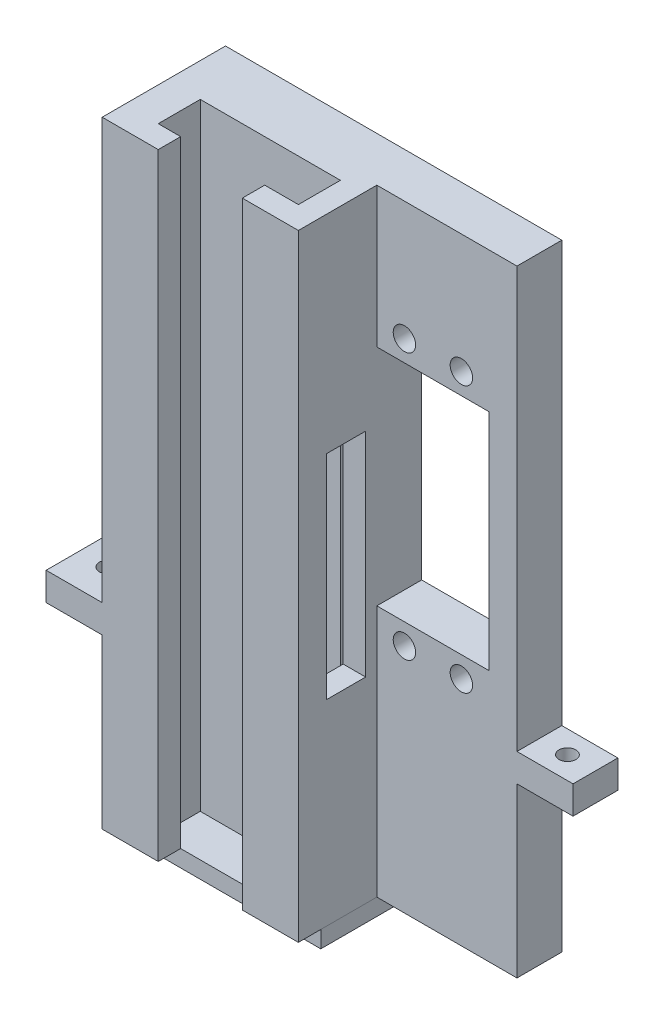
ISO-10303-21;
HEADER;
FILE_DESCRIPTION(('STEP AP214'),'2;1');
FILE_NAME('part.step','',(''),(''),'','','');
FILE_SCHEMA(('AUTOMOTIVE_DESIGN { 1 0 10303 214 1 1 1 1 }'));
ENDSEC;
DATA;
#1=APPLICATION_CONTEXT('core data for automotive mechanical design processes');
#2=APPLICATION_PROTOCOL_DEFINITION('international standard','automotive_design',2000,#1);
#3=PRODUCT_CONTEXT('',#1,'mechanical');
#4=PRODUCT('Part','Part','',(#3));
#5=PRODUCT_RELATED_PRODUCT_CATEGORY('part','',(#4));
#6=PRODUCT_DEFINITION_FORMATION('','',#4);
#7=PRODUCT_DEFINITION_CONTEXT('part definition',#1,'design');
#8=PRODUCT_DEFINITION('design','',#6,#7);
#9=PRODUCT_DEFINITION_SHAPE('','',#8);
#10=(LENGTH_UNIT() NAMED_UNIT(*) SI_UNIT(.MILLI.,.METRE.));
#11=(NAMED_UNIT(*) PLANE_ANGLE_UNIT() SI_UNIT($,.RADIAN.));
#12=(NAMED_UNIT(*) SI_UNIT($,.STERADIAN.) SOLID_ANGLE_UNIT());
#13=UNCERTAINTY_MEASURE_WITH_UNIT(LENGTH_MEASURE(1.E-05),#10,'distance_accuracy_value','');
#14=(GEOMETRIC_REPRESENTATION_CONTEXT(3) GLOBAL_UNCERTAINTY_ASSIGNED_CONTEXT((#13)) GLOBAL_UNIT_ASSIGNED_CONTEXT((#10,
#11,#12)) REPRESENTATION_CONTEXT('',''));
#15=CARTESIAN_POINT('',(0.,0.,0.));
#16=DIRECTION('',(0.,0.,1.));
#17=DIRECTION('',(1.,0.,0.));
#18=AXIS2_PLACEMENT_3D('',#15,#16,#17);
#19=CARTESIAN_POINT('',(-17.5,-73.,9.99999999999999));
#20=DIRECTION('',(1.,0.,0.));
#21=DIRECTION('',(0.,0.,-1.));
#22=AXIS2_PLACEMENT_3D('',#19,#20,#21);
#23=PLANE('',#22);
#24=DIRECTION('',(0.,0.,-1.));
#25=VECTOR('',#24,1.);
#26=CARTESIAN_POINT('',(-17.5,-70.,9.99999999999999));
#27=LINE('',#26,#25);
#28=CARTESIAN_POINT('',(-17.5,-70.,9.99999999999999));
#29=VERTEX_POINT('',#28);
#30=CARTESIAN_POINT('',(-17.5,-70.,-8.));
#31=VERTEX_POINT('',#30);
#32=EDGE_CURVE('E106',#29,#31,#27,.T.);
#33=ORIENTED_EDGE('',*,*,#32,.T.);
#34=DIRECTION('',(0.,1.,0.));
#35=VECTOR('',#34,1.);
#36=CARTESIAN_POINT('',(-17.5,-73.,-8.));
#37=LINE('',#36,#35);
#38=CARTESIAN_POINT('',(-17.5,-73.,-8.));
#39=VERTEX_POINT('',#38);
#40=EDGE_CURVE('E12',#39,#31,#37,.T.);
#41=ORIENTED_EDGE('',*,*,#40,.F.);
#42=DIRECTION('',(0.,0.,-1.));
#43=VECTOR('',#42,1.);
#44=CARTESIAN_POINT('',(-17.5,-73.,9.99999999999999));
#45=LINE('',#44,#43);
#46=CARTESIAN_POINT('',(-17.5,-73.,9.99999999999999));
#47=VERTEX_POINT('',#46);
#48=EDGE_CURVE('E94',#47,#39,#45,.T.);
#49=ORIENTED_EDGE('',*,*,#48,.F.);
#50=DIRECTION('',(0.,1.,0.));
#51=VECTOR('',#50,1.);
#52=CARTESIAN_POINT('',(-17.5,-73.,9.99999999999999));
#53=LINE('',#52,#51);
#54=EDGE_CURVE('E102',#47,#29,#53,.T.);
#55=ORIENTED_EDGE('',*,*,#54,.T.);
#56=EDGE_LOOP('',(#33,#41,#49,#55));
#57=FACE_BOUND('',#56,.T.);
#58=ADVANCED_FACE('F43',(#57),#23,.F.);
#59=CARTESIAN_POINT('',(-17.5,-73.,-8.));
#60=DIRECTION('',(0.,0.,1.));
#61=DIRECTION('',(1.,0.,0.));
#62=AXIS2_PLACEMENT_3D('',#59,#60,#61);
#63=PLANE('',#62);
#64=DIRECTION('',(1.,0.,0.));
#65=VECTOR('',#64,1.);
#66=CARTESIAN_POINT('',(-17.5,-70.,-8.));
#67=LINE('',#66,#65);
#68=CARTESIAN_POINT('',(17.5,-70.,-8.00000000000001));
#69=VERTEX_POINT('',#68);
#70=EDGE_CURVE('E98',#31,#69,#67,.T.);
#71=ORIENTED_EDGE('',*,*,#70,.T.);
#72=DIRECTION('',(0.,1.,0.));
#73=VECTOR('',#72,1.);
#74=CARTESIAN_POINT('',(17.5,-73.,-8.00000000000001));
#75=LINE('',#74,#73);
#76=CARTESIAN_POINT('',(17.5,-73.,-8.00000000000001));
#77=VERTEX_POINT('',#76);
#78=EDGE_CURVE('E51',#77,#69,#75,.T.);
#79=ORIENTED_EDGE('',*,*,#78,.F.);
#80=DIRECTION('',(1.,0.,0.));
#81=VECTOR('',#80,1.);
#82=CARTESIAN_POINT('',(-17.5,-73.,-8.));
#83=LINE('',#82,#81);
#84=EDGE_CURVE('E89',#39,#77,#83,.T.);
#85=ORIENTED_EDGE('',*,*,#84,.F.);
#86=ORIENTED_EDGE('',*,*,#40,.T.);
#87=EDGE_LOOP('',(#71,#79,#85,#86));
#88=FACE_BOUND('',#87,.T.);
#89=ADVANCED_FACE('F97',(#88),#63,.F.);
#90=CARTESIAN_POINT('',(17.5,-73.,10.));
#91=DIRECTION('',(-1.,0.,0.));
#92=DIRECTION('',(0.,0.,1.));
#93=AXIS2_PLACEMENT_3D('',#90,#91,#92);
#94=PLANE('',#93);
#95=DIRECTION('',(0.,0.,1.));
#96=VECTOR('',#95,1.);
#97=CARTESIAN_POINT('',(17.5,-70.,10.));
#98=LINE('',#97,#96);
#99=CARTESIAN_POINT('',(17.5,-70.,10.));
#100=VERTEX_POINT('',#99);
#101=EDGE_CURVE('E76',#69,#100,#98,.T.);
#102=ORIENTED_EDGE('',*,*,#101,.T.);
#103=DIRECTION('',(0.,1.,0.));
#104=VECTOR('',#103,1.);
#105=CARTESIAN_POINT('',(17.5,-73.,10.));
#106=LINE('',#105,#104);
#107=CARTESIAN_POINT('',(17.5,-73.,10.));
#108=VERTEX_POINT('',#107);
#109=EDGE_CURVE('E99',#108,#100,#106,.T.);
#110=ORIENTED_EDGE('',*,*,#109,.F.);
#111=DIRECTION('',(0.,0.,1.));
#112=VECTOR('',#111,1.);
#113=CARTESIAN_POINT('',(17.5,-73.,10.));
#114=LINE('',#113,#112);
#115=EDGE_CURVE('E92',#77,#108,#114,.T.);
#116=ORIENTED_EDGE('',*,*,#115,.F.);
#117=ORIENTED_EDGE('',*,*,#78,.T.);
#118=EDGE_LOOP('',(#102,#110,#116,#117));
#119=FACE_BOUND('',#118,.T.);
#120=ADVANCED_FACE('F100',(#119),#94,.F.);
#121=CARTESIAN_POINT('',(-17.5,-73.,9.99999999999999));
#122=DIRECTION('',(0.,0.,-1.));
#123=DIRECTION('',(-1.,0.,0.));
#124=AXIS2_PLACEMENT_3D('',#121,#122,#123);
#125=PLANE('',#124);
#126=DIRECTION('',(-1.,0.,0.));
#127=VECTOR('',#126,1.);
#128=CARTESIAN_POINT('',(-17.5,-70.,9.99999999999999));
#129=LINE('',#128,#127);
#130=EDGE_CURVE('E82',#100,#29,#129,.T.);
#131=ORIENTED_EDGE('',*,*,#130,.T.);
#132=ORIENTED_EDGE('',*,*,#54,.F.);
#133=DIRECTION('',(-1.,0.,0.));
#134=VECTOR('',#133,1.);
#135=CARTESIAN_POINT('',(-17.5,-73.,9.99999999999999));
#136=LINE('',#135,#134);
#137=EDGE_CURVE('E59',#108,#47,#136,.T.);
#138=ORIENTED_EDGE('',*,*,#137,.F.);
#139=ORIENTED_EDGE('',*,*,#109,.T.);
#140=EDGE_LOOP('',(#131,#132,#138,#139));
#141=FACE_BOUND('',#140,.T.);
#142=ADVANCED_FACE('F113',(#141),#125,.F.);
#143=CARTESIAN_POINT('',(0.,-73.,0.));
#144=DIRECTION('',(0.,-1.,0.));
#145=DIRECTION('',(0.,0.,-1.));
#146=AXIS2_PLACEMENT_3D('',#143,#144,#145);
#147=PLANE('',#146);
#148=ORIENTED_EDGE('',*,*,#48,.T.);
#149=ORIENTED_EDGE('',*,*,#84,.T.);
#150=ORIENTED_EDGE('',*,*,#115,.T.);
#151=ORIENTED_EDGE('',*,*,#137,.T.);
#152=EDGE_LOOP('',(#148,#149,#150,#151));
#153=FACE_BOUND('',#152,.T.);
#154=ADVANCED_FACE('F90',(#153),#147,.T.);
#155=CARTESIAN_POINT('',(0.,-70.,0.));
#156=DIRECTION('',(0.,-1.,0.));
#157=DIRECTION('',(0.,0.,-1.));
#158=AXIS2_PLACEMENT_3D('',#155,#156,#157);
#159=PLANE('',#158);
#160=ORIENTED_EDGE('',*,*,#32,.F.);
#161=ORIENTED_EDGE('',*,*,#130,.F.);
#162=ORIENTED_EDGE('',*,*,#101,.F.);
#163=ORIENTED_EDGE('',*,*,#70,.F.);
#164=EDGE_LOOP('',(#160,#161,#162,#163));
#165=FACE_BOUND('',#164,.T.);
#166=ADVANCED_FACE('F116',(#165),#159,.F.);
#167=CLOSED_SHELL('',(#58,#89,#120,#142,#154,#166));
#168=MANIFOLD_SOLID_BREP('B2',#167);
#169=CARTESIAN_POINT('',(42.5,40.,112.805141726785));
#170=DIRECTION('',(1.,0.,0.));
#171=DIRECTION('',(0.,1.,0.));
#172=AXIS2_PLACEMENT_3D('',#169,#170,#171);
#173=PLANE('',#172);
#174=DIRECTION('',(0.,-1.,0.));
#175=VECTOR('',#174,1.);
#176=CARTESIAN_POINT('',(42.5,40.,0.));
#177=LINE('',#176,#175);
#178=CARTESIAN_POINT('',(42.5,40.,0.));
#179=VERTEX_POINT('',#178);
#180=CARTESIAN_POINT('',(42.5,-35.,0.));
#181=VERTEX_POINT('',#180);
#182=EDGE_CURVE('E581',#179,#181,#177,.T.);
#183=ORIENTED_EDGE('',*,*,#182,.T.);
#184=DIRECTION('',(0.,0.,-1.));
#185=VECTOR('',#184,1.);
#186=CARTESIAN_POINT('',(42.5,-35.,0.));
#187=LINE('',#186,#185);
#188=CARTESIAN_POINT('',(42.5,-35.,-8.00000000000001));
#189=VERTEX_POINT('',#188);
#190=EDGE_CURVE('E182',#181,#189,#187,.T.);
#191=ORIENTED_EDGE('',*,*,#190,.T.);
#192=DIRECTION('',(0.,-1.,0.));
#193=VECTOR('',#192,1.);
#194=CARTESIAN_POINT('',(42.5,40.,-8.00000000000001));
#195=LINE('',#194,#193);
#196=CARTESIAN_POINT('',(42.5,40.,-8.00000000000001));
#197=VERTEX_POINT('',#196);
#198=EDGE_CURVE('E400',#197,#189,#195,.T.);
#199=ORIENTED_EDGE('',*,*,#198,.F.);
#200=DIRECTION('',(0.,0.,-1.));
#201=VECTOR('',#200,1.);
#202=CARTESIAN_POINT('',(42.5,40.,112.805141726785));
#203=LINE('',#202,#201);
#204=EDGE_CURVE('E586',#179,#197,#203,.T.);
#205=ORIENTED_EDGE('',*,*,#204,.F.);
#206=EDGE_LOOP('',(#183,#191,#199,#205));
#207=FACE_BOUND('',#206,.T.);
#208=ADVANCED_FACE('F167',(#207),#173,.T.);
#209=CARTESIAN_POINT('',(-17.5,-70.,-8.));
#210=DIRECTION('',(-1.,0.,0.));
#211=DIRECTION('',(0.,0.,1.));
#212=AXIS2_PLACEMENT_3D('',#209,#210,#211);
#213=PLANE('',#212);
#214=DIRECTION('',(0.,1.,0.));
#215=VECTOR('',#214,1.);
#216=CARTESIAN_POINT('',(-17.5,-70.,-8.));
#217=LINE('',#216,#215);
#218=CARTESIAN_POINT('',(-17.5,-35.,-8.));
#219=VERTEX_POINT('',#218);
#220=CARTESIAN_POINT('',(-17.5,40.,-8.));
#221=VERTEX_POINT('',#220);
#222=EDGE_CURVE('E694',#219,#221,#217,.T.);
#223=ORIENTED_EDGE('',*,*,#222,.F.);
#224=DIRECTION('',(0.,0.,1.));
#225=VECTOR('',#224,1.);
#226=CARTESIAN_POINT('',(-17.5,-35.,14.));
#227=LINE('',#226,#225);
#228=CARTESIAN_POINT('',(-17.5,-35.,14.));
#229=VERTEX_POINT('',#228);
#230=EDGE_CURVE('E448',#219,#229,#227,.T.);
#231=ORIENTED_EDGE('',*,*,#230,.T.);
#232=DIRECTION('',(0.,1.,0.));
#233=VECTOR('',#232,1.);
#234=CARTESIAN_POINT('',(-17.5,-70.,14.));
#235=LINE('',#234,#233);
#236=CARTESIAN_POINT('',(-17.5,40.,14.));
#237=VERTEX_POINT('',#236);
#238=EDGE_CURVE('E691',#229,#237,#235,.T.);
#239=ORIENTED_EDGE('',*,*,#238,.T.);
#240=DIRECTION('',(0.,0.,1.));
#241=VECTOR('',#240,1.);
#242=CARTESIAN_POINT('',(-17.5,40.,-8.));
#243=LINE('',#242,#241);
#244=EDGE_CURVE('E633',#221,#237,#243,.T.);
#245=ORIENTED_EDGE('',*,*,#244,.F.);
#246=EDGE_LOOP('',(#223,#231,#239,#245));
#247=FACE_BOUND('',#246,.T.);
#248=ADVANCED_FACE('F772',(#247),#213,.T.);
#249=CARTESIAN_POINT('',(17.5,-70.,14.));
#250=DIRECTION('',(1.,0.,0.));
#251=DIRECTION('',(0.,0.,-1.));
#252=AXIS2_PLACEMENT_3D('',#249,#250,#251);
#253=PLANE('',#252);
#254=DIRECTION('',(0.,1.,0.));
#255=VECTOR('',#254,1.);
#256=CARTESIAN_POINT('',(17.5,40.,0.));
#257=LINE('',#256,#255);
#258=CARTESIAN_POINT('',(17.5,-70.,0.));
#259=VERTEX_POINT('',#258);
#260=CARTESIAN_POINT('',(17.5,-25.,0.));
#261=VERTEX_POINT('',#260);
#262=EDGE_CURVE('E573',#259,#261,#257,.T.);
#263=ORIENTED_EDGE('',*,*,#262,.T.);
#264=DIRECTION('',(0.,0.,-1.));
#265=VECTOR('',#264,1.);
#266=CARTESIAN_POINT('',(17.5,-25.,46.7213595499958));
#267=LINE('',#266,#265);
#268=CARTESIAN_POINT('',(17.5,-25.,-8.));
#269=VERTEX_POINT('',#268);
#270=EDGE_CURVE('E568',#261,#269,#267,.T.);
#271=ORIENTED_EDGE('',*,*,#270,.T.);
#272=DIRECTION('',(0.,1.,0.));
#273=VECTOR('',#272,1.);
#274=CARTESIAN_POINT('',(17.5,15.,-8.));
#275=LINE('',#274,#273);
#276=CARTESIAN_POINT('',(17.5,15.,-8.));
#277=VERTEX_POINT('',#276);
#278=EDGE_CURVE('E558',#269,#277,#275,.T.);
#279=ORIENTED_EDGE('',*,*,#278,.T.);
#280=DIRECTION('',(0.,0.,-1.));
#281=VECTOR('',#280,1.);
#282=CARTESIAN_POINT('',(17.5,15.,46.7213595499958));
#283=LINE('',#282,#281);
#284=CARTESIAN_POINT('',(17.5,15.,0.));
#285=VERTEX_POINT('',#284);
#286=EDGE_CURVE('E566',#285,#277,#283,.T.);
#287=ORIENTED_EDGE('',*,*,#286,.F.);
#288=CARTESIAN_POINT('',(17.5,40.,0.));
#289=VERTEX_POINT('',#288);
#290=EDGE_CURVE('E572',#285,#289,#257,.T.);
#291=ORIENTED_EDGE('',*,*,#290,.T.);
#292=DIRECTION('',(0.,0.,-1.));
#293=VECTOR('',#292,1.);
#294=CARTESIAN_POINT('',(17.5,40.,14.));
#295=LINE('',#294,#293);
#296=CARTESIAN_POINT('',(17.5,40.,14.));
#297=VERTEX_POINT('',#296);
#298=EDGE_CURVE('E627',#297,#289,#295,.T.);
#299=ORIENTED_EDGE('',*,*,#298,.F.);
#300=DIRECTION('',(0.,1.,0.));
#301=VECTOR('',#300,1.);
#302=CARTESIAN_POINT('',(17.5,-70.,14.));
#303=LINE('',#302,#301);
#304=CARTESIAN_POINT('',(17.5,-70.,14.));
#305=VERTEX_POINT('',#304);
#306=EDGE_CURVE('E695',#305,#297,#303,.T.);
#307=ORIENTED_EDGE('',*,*,#306,.F.);
#308=DIRECTION('',(0.,0.,-1.));
#309=VECTOR('',#308,1.);
#310=CARTESIAN_POINT('',(17.5,-70.,14.));
#311=LINE('',#310,#309);
#312=EDGE_CURVE('E656',#305,#259,#311,.T.);
#313=ORIENTED_EDGE('',*,*,#312,.T.);
#314=EDGE_LOOP('',(#263,#271,#279,#287,#291,#299,#307,#313));
#315=FACE_BOUND('',#314,.T.);
#316=DIRECTION('',(0.,0.,1.));
#317=VECTOR('',#316,1.);
#318=CARTESIAN_POINT('',(17.5,2.99999999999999,9.));
#319=LINE('',#318,#317);
#320=CARTESIAN_POINT('',(17.5,2.99999999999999,2.));
#321=VERTEX_POINT('',#320);
#322=CARTESIAN_POINT('',(17.5,2.99999999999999,9.));
#323=VERTEX_POINT('',#322);
#324=EDGE_CURVE('E596',#321,#323,#319,.T.);
#325=ORIENTED_EDGE('',*,*,#324,.F.);
#326=DIRECTION('',(0.,1.,0.));
#327=VECTOR('',#326,1.);
#328=CARTESIAN_POINT('',(17.5,2.99999999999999,2.));
#329=LINE('',#328,#327);
#330=CARTESIAN_POINT('',(17.5,-35.,1.99999999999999));
#331=VERTEX_POINT('',#330);
#332=EDGE_CURVE('E594',#331,#321,#329,.T.);
#333=ORIENTED_EDGE('',*,*,#332,.F.);
#334=DIRECTION('',(0.,0.,-1.));
#335=VECTOR('',#334,1.);
#336=CARTESIAN_POINT('',(17.5,-35.,8.99999999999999));
#337=LINE('',#336,#335);
#338=CARTESIAN_POINT('',(17.5,-35.,8.99999999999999));
#339=VERTEX_POINT('',#338);
#340=EDGE_CURVE('E591',#339,#331,#337,.T.);
#341=ORIENTED_EDGE('',*,*,#340,.F.);
#342=DIRECTION('',(0.,-1.,0.));
#343=VECTOR('',#342,1.);
#344=CARTESIAN_POINT('',(17.5,2.99999999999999,9.));
#345=LINE('',#344,#343);
#346=EDGE_CURVE('E580',#323,#339,#345,.T.);
#347=ORIENTED_EDGE('',*,*,#346,.F.);
#348=EDGE_LOOP('',(#325,#333,#341,#347));
#349=FACE_BOUND('',#348,.T.);
#350=ADVANCED_FACE('F716',(#315,#349),#253,.T.);
#351=CARTESIAN_POINT('',(7.5,-70.,10.));
#352=DIRECTION('',(-1.,0.,0.));
#353=DIRECTION('',(0.,0.,1.));
#354=AXIS2_PLACEMENT_3D('',#351,#352,#353);
#355=PLANE('',#354);
#356=DIRECTION('',(0.,1.,0.));
#357=VECTOR('',#356,1.);
#358=CARTESIAN_POINT('',(7.5,-70.,14.));
#359=LINE('',#358,#357);
#360=CARTESIAN_POINT('',(7.5,-70.,14.));
#361=VERTEX_POINT('',#360);
#362=CARTESIAN_POINT('',(7.5,40.,14.));
#363=VERTEX_POINT('',#362);
#364=EDGE_CURVE('E678',#361,#363,#359,.T.);
#365=ORIENTED_EDGE('',*,*,#364,.T.);
#366=DIRECTION('',(0.,0.,1.));
#367=VECTOR('',#366,1.);
#368=CARTESIAN_POINT('',(7.5,40.,10.));
#369=LINE('',#368,#367);
#370=CARTESIAN_POINT('',(7.5,40.,10.));
#371=VERTEX_POINT('',#370);
#372=EDGE_CURVE('E621',#371,#363,#369,.T.);
#373=ORIENTED_EDGE('',*,*,#372,.F.);
#374=DIRECTION('',(0.,1.,0.));
#375=VECTOR('',#374,1.);
#376=CARTESIAN_POINT('',(7.5,-70.,10.));
#377=LINE('',#376,#375);
#378=CARTESIAN_POINT('',(7.5,-70.,10.));
#379=VERTEX_POINT('',#378);
#380=EDGE_CURVE('E679',#379,#371,#377,.T.);
#381=ORIENTED_EDGE('',*,*,#380,.F.);
#382=DIRECTION('',(0.,0.,1.));
#383=VECTOR('',#382,1.);
#384=CARTESIAN_POINT('',(7.5,-70.,10.));
#385=LINE('',#384,#383);
#386=EDGE_CURVE('E650',#379,#361,#385,.T.);
#387=ORIENTED_EDGE('',*,*,#386,.T.);
#388=EDGE_LOOP('',(#365,#373,#381,#387));
#389=FACE_BOUND('',#388,.T.);
#390=ADVANCED_FACE('F169',(#389),#355,.T.);
#391=CARTESIAN_POINT('',(7.5,-70.,10.));
#392=DIRECTION('',(0.,0.,-1.));
#393=DIRECTION('',(-1.,0.,0.));
#394=AXIS2_PLACEMENT_3D('',#391,#392,#393);
#395=PLANE('',#394);
#396=ORIENTED_EDGE('',*,*,#380,.T.);
#397=DIRECTION('',(-1.,0.,0.));
#398=VECTOR('',#397,1.);
#399=CARTESIAN_POINT('',(7.5,40.,10.));
#400=LINE('',#399,#398);
#401=CARTESIAN_POINT('',(13.5,40.,10.));
#402=VERTEX_POINT('',#401);
#403=EDGE_CURVE('E647',#402,#371,#400,.T.);
#404=ORIENTED_EDGE('',*,*,#403,.F.);
#405=DIRECTION('',(0.,1.,0.));
#406=VECTOR('',#405,1.);
#407=CARTESIAN_POINT('',(13.5,-70.,10.));
#408=LINE('',#407,#406);
#409=CARTESIAN_POINT('',(13.5,-70.,10.));
#410=VERTEX_POINT('',#409);
#411=EDGE_CURVE('E682',#410,#402,#408,.T.);
#412=ORIENTED_EDGE('',*,*,#411,.F.);
#413=DIRECTION('',(-1.,0.,0.));
#414=VECTOR('',#413,1.);
#415=CARTESIAN_POINT('',(7.5,-70.,10.));
#416=LINE('',#415,#414);
#417=EDGE_CURVE('E675',#410,#379,#416,.T.);
#418=ORIENTED_EDGE('',*,*,#417,.T.);
#419=EDGE_LOOP('',(#396,#404,#412,#418));
#420=FACE_BOUND('',#419,.T.);
#421=ADVANCED_FACE('F738',(#420),#395,.T.);
#422=CARTESIAN_POINT('',(13.5,-70.,10.));
#423=DIRECTION('',(-1.,0.,0.));
#424=DIRECTION('',(0.,0.,1.));
#425=AXIS2_PLACEMENT_3D('',#422,#423,#424);
#426=PLANE('',#425);
#427=DIRECTION('',(0.,1.,0.));
#428=VECTOR('',#427,1.);
#429=CARTESIAN_POINT('',(13.5,-98.792360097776,2.5));
#430=LINE('',#429,#428);
#431=CARTESIAN_POINT('',(13.5,-70.,2.5));
#432=VERTEX_POINT('',#431);
#433=CARTESIAN_POINT('',(13.5,-35.,2.5));
#434=VERTEX_POINT('',#433);
#435=EDGE_CURVE('E544',#432,#434,#430,.T.);
#436=ORIENTED_EDGE('',*,*,#435,.F.);
#437=DIRECTION('',(0.,0.,1.));
#438=VECTOR('',#437,1.);
#439=CARTESIAN_POINT('',(13.5,-70.,10.));
#440=LINE('',#439,#438);
#441=EDGE_CURVE('E673',#432,#410,#440,.T.);
#442=ORIENTED_EDGE('',*,*,#441,.T.);
#443=ORIENTED_EDGE('',*,*,#411,.T.);
#444=DIRECTION('',(0.,0.,1.));
#445=VECTOR('',#444,1.);
#446=CARTESIAN_POINT('',(13.5,40.,10.));
#447=LINE('',#446,#445);
#448=CARTESIAN_POINT('',(13.5,40.,2.5));
#449=VERTEX_POINT('',#448);
#450=EDGE_CURVE('E645',#449,#402,#447,.T.);
#451=ORIENTED_EDGE('',*,*,#450,.F.);
#452=CARTESIAN_POINT('',(13.5,2.99999999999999,2.5));
#453=VERTEX_POINT('',#452);
#454=EDGE_CURVE('E547',#453,#449,#430,.T.);
#455=ORIENTED_EDGE('',*,*,#454,.F.);
#456=DIRECTION('',(0.,0.,-1.));
#457=VECTOR('',#456,1.);
#458=CARTESIAN_POINT('',(13.5,2.99999999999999,10.));
#459=LINE('',#458,#457);
#460=CARTESIAN_POINT('',(13.5,2.99999999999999,9.));
#461=VERTEX_POINT('',#460);
#462=EDGE_CURVE('E616',#461,#453,#459,.T.);
#463=ORIENTED_EDGE('',*,*,#462,.F.);
#464=DIRECTION('',(0.,1.,0.));
#465=VECTOR('',#464,1.);
#466=CARTESIAN_POINT('',(13.5,-70.,8.99999999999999));
#467=LINE('',#466,#465);
#468=CARTESIAN_POINT('',(13.5,-35.,8.99999999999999));
#469=VERTEX_POINT('',#468);
#470=EDGE_CURVE('E619',#469,#461,#467,.T.);
#471=ORIENTED_EDGE('',*,*,#470,.F.);
#472=DIRECTION('',(0.,0.,1.));
#473=VECTOR('',#472,1.);
#474=CARTESIAN_POINT('',(13.5,-35.,10.));
#475=LINE('',#474,#473);
#476=EDGE_CURVE('E602',#434,#469,#475,.T.);
#477=ORIENTED_EDGE('',*,*,#476,.F.);
#478=EDGE_LOOP('',(#436,#442,#443,#451,#455,#463,#471,#477));
#479=FACE_BOUND('',#478,.T.);
#480=ADVANCED_FACE('F743',(#479),#426,.T.);
#481=CARTESIAN_POINT('',(-13.5,-70.,10.));
#482=DIRECTION('',(0.,0.,-1.));
#483=DIRECTION('',(-1.,0.,0.));
#484=AXIS2_PLACEMENT_3D('',#481,#482,#483);
#485=PLANE('',#484);
#486=DIRECTION('',(0.,1.,0.));
#487=VECTOR('',#486,1.);
#488=CARTESIAN_POINT('',(-11.5,-98.792360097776,10.));
#489=LINE('',#488,#487);
#490=CARTESIAN_POINT('',(-11.5,-70.,10.));
#491=VERTEX_POINT('',#490);
#492=CARTESIAN_POINT('',(-11.5,40.,10.));
#493=VERTEX_POINT('',#492);
#494=EDGE_CURVE('E535',#491,#493,#489,.T.);
#495=ORIENTED_EDGE('',*,*,#494,.T.);
#496=DIRECTION('',(-1.,0.,0.));
#497=VECTOR('',#496,1.);
#498=CARTESIAN_POINT('',(-13.5,40.,10.));
#499=LINE('',#498,#497);
#500=CARTESIAN_POINT('',(-7.5,40.,10.));
#501=VERTEX_POINT('',#500);
#502=EDGE_CURVE('E642',#501,#493,#499,.T.);
#503=ORIENTED_EDGE('',*,*,#502,.F.);
#504=DIRECTION('',(0.,1.,0.));
#505=VECTOR('',#504,1.);
#506=CARTESIAN_POINT('',(-7.5,-70.,10.));
#507=LINE('',#506,#505);
#508=CARTESIAN_POINT('',(-7.5,-70.,10.));
#509=VERTEX_POINT('',#508);
#510=EDGE_CURVE('E685',#509,#501,#507,.T.);
#511=ORIENTED_EDGE('',*,*,#510,.F.);
#512=DIRECTION('',(-1.,0.,0.));
#513=VECTOR('',#512,1.);
#514=CARTESIAN_POINT('',(-13.5,-70.,10.));
#515=LINE('',#514,#513);
#516=EDGE_CURVE('E670',#509,#491,#515,.T.);
#517=ORIENTED_EDGE('',*,*,#516,.T.);
#518=EDGE_LOOP('',(#495,#503,#511,#517));
#519=FACE_BOUND('',#518,.T.);
#520=ADVANCED_FACE('F760',(#519),#485,.T.);
#521=CARTESIAN_POINT('',(-7.5,-70.,10.));
#522=DIRECTION('',(1.,0.,0.));
#523=DIRECTION('',(0.,0.,-1.));
#524=AXIS2_PLACEMENT_3D('',#521,#522,#523);
#525=PLANE('',#524);
#526=ORIENTED_EDGE('',*,*,#510,.T.);
#527=DIRECTION('',(0.,0.,-1.));
#528=VECTOR('',#527,1.);
#529=CARTESIAN_POINT('',(-7.5,40.,10.));
#530=LINE('',#529,#528);
#531=CARTESIAN_POINT('',(-7.49999999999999,40.,14.));
#532=VERTEX_POINT('',#531);
#533=EDGE_CURVE('E639',#532,#501,#530,.T.);
#534=ORIENTED_EDGE('',*,*,#533,.F.);
#535=DIRECTION('',(0.,1.,0.));
#536=VECTOR('',#535,1.);
#537=CARTESIAN_POINT('',(-7.49999999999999,-70.,14.));
#538=LINE('',#537,#536);
#539=CARTESIAN_POINT('',(-7.49999999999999,-70.,14.));
#540=VERTEX_POINT('',#539);
#541=EDGE_CURVE('E687',#540,#532,#538,.T.);
#542=ORIENTED_EDGE('',*,*,#541,.F.);
#543=DIRECTION('',(0.,0.,-1.));
#544=VECTOR('',#543,1.);
#545=CARTESIAN_POINT('',(-7.5,-70.,10.));
#546=LINE('',#545,#544);
#547=EDGE_CURVE('E667',#540,#509,#546,.T.);
#548=ORIENTED_EDGE('',*,*,#547,.T.);
#549=EDGE_LOOP('',(#526,#534,#542,#548));
#550=FACE_BOUND('',#549,.T.);
#551=ADVANCED_FACE('F764',(#550),#525,.T.);
#552=CARTESIAN_POINT('',(-17.5,-70.,14.));
#553=DIRECTION('',(0.,0.,1.));
#554=DIRECTION('',(1.,0.,0.));
#555=AXIS2_PLACEMENT_3D('',#552,#553,#554);
#556=PLANE('',#555);
#557=ORIENTED_EDGE('',*,*,#541,.T.);
#558=DIRECTION('',(1.,0.,0.));
#559=VECTOR('',#558,1.);
#560=CARTESIAN_POINT('',(-17.5,40.,14.));
#561=LINE('',#560,#559);
#562=EDGE_CURVE('E636',#237,#532,#561,.T.);
#563=ORIENTED_EDGE('',*,*,#562,.F.);
#564=ORIENTED_EDGE('',*,*,#238,.F.);
#565=DIRECTION('',(-1.,0.,0.));
#566=VECTOR('',#565,1.);
#567=CARTESIAN_POINT('',(-17.5,-35.,14.));
#568=LINE('',#567,#566);
#569=CARTESIAN_POINT('',(-27.5,-35.,14.));
#570=VERTEX_POINT('',#569);
#571=EDGE_CURVE('E464',#229,#570,#568,.T.);
#572=ORIENTED_EDGE('',*,*,#571,.T.);
#573=DIRECTION('',(0.,1.,0.));
#574=VECTOR('',#573,1.);
#575=CARTESIAN_POINT('',(-27.5,-40.,14.));
#576=LINE('',#575,#574);
#577=CARTESIAN_POINT('',(-27.5,-40.,14.));
#578=VERTEX_POINT('',#577);
#579=EDGE_CURVE('E472',#578,#570,#576,.T.);
#580=ORIENTED_EDGE('',*,*,#579,.F.);
#581=DIRECTION('',(-1.,0.,0.));
#582=VECTOR('',#581,1.);
#583=CARTESIAN_POINT('',(-17.5,-40.,14.));
#584=LINE('',#583,#582);
#585=CARTESIAN_POINT('',(-17.5,-40.,14.));
#586=VERTEX_POINT('',#585);
#587=EDGE_CURVE('E454',#586,#578,#584,.T.);
#588=ORIENTED_EDGE('',*,*,#587,.F.);
#589=CARTESIAN_POINT('',(-17.5,-70.,14.));
#590=VERTEX_POINT('',#589);
#591=EDGE_CURVE('E689',#590,#586,#235,.T.);
#592=ORIENTED_EDGE('',*,*,#591,.F.);
#593=DIRECTION('',(1.,0.,0.));
#594=VECTOR('',#593,1.);
#595=CARTESIAN_POINT('',(-17.5,-70.,14.));
#596=LINE('',#595,#594);
#597=EDGE_CURVE('E664',#590,#540,#596,.T.);
#598=ORIENTED_EDGE('',*,*,#597,.T.);
#599=EDGE_LOOP('',(#557,#563,#564,#572,#580,#588,#592,#598));
#600=FACE_BOUND('',#599,.T.);
#601=ADVANCED_FACE('F768',(#600),#556,.T.);
#602=DIRECTION('',(0.,0.,1.));
#603=VECTOR('',#602,1.);
#604=CARTESIAN_POINT('',(-17.5,-40.,14.));
#605=LINE('',#604,#603);
#606=CARTESIAN_POINT('',(-17.5,-40.,-8.));
#607=VERTEX_POINT('',#606);
#608=EDGE_CURVE('E451',#607,#586,#605,.T.);
#609=ORIENTED_EDGE('',*,*,#608,.F.);
#610=CARTESIAN_POINT('',(-17.5,-70.,-8.));
#611=VERTEX_POINT('',#610);
#612=EDGE_CURVE('E692',#611,#607,#217,.T.);
#613=ORIENTED_EDGE('',*,*,#612,.F.);
#614=DIRECTION('',(0.,0.,1.));
#615=VECTOR('',#614,1.);
#616=CARTESIAN_POINT('',(-17.5,-70.,-8.));
#617=LINE('',#616,#615);
#618=EDGE_CURVE('E661',#611,#590,#617,.T.);
#619=ORIENTED_EDGE('',*,*,#618,.T.);
#620=ORIENTED_EDGE('',*,*,#591,.T.);
#621=EDGE_LOOP('',(#609,#613,#619,#620));
#622=FACE_BOUND('',#621,.T.);
#623=ADVANCED_FACE('F792',(#622),#213,.T.);
#624=CARTESIAN_POINT('',(17.5,-70.,-8.));
#625=DIRECTION('',(0.,0.,-1.));
#626=DIRECTION('',(-1.,0.,0.));
#627=AXIS2_PLACEMENT_3D('',#624,#625,#626);
#628=PLANE('',#627);
#629=CARTESIAN_POINT('',(32.58,18.749,-8.00000000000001));
#630=DIRECTION('',(0.,0.,-1.));
#631=DIRECTION('',(-1.,0.,0.));
#632=AXIS2_PLACEMENT_3D('',#629,#630,#631);
#633=CIRCLE('',#632,2.);
#634=CARTESIAN_POINT('',(30.58,18.749,-8.00000000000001));
#635=VERTEX_POINT('',#634);
#636=EDGE_CURVE('E482',#635,#635,#633,.T.);
#637=ORIENTED_EDGE('',*,*,#636,.F.);
#638=EDGE_LOOP('',(#637));
#639=FACE_BOUND('',#638,.T.);
#640=CARTESIAN_POINT('',(22.42,-28.749,-8.));
#641=DIRECTION('',(0.,0.,-1.));
#642=DIRECTION('',(-1.,0.,0.));
#643=AXIS2_PLACEMENT_3D('',#640,#641,#642);
#644=CIRCLE('',#643,2.);
#645=CARTESIAN_POINT('',(20.42,-28.749,-8.));
#646=VERTEX_POINT('',#645);
#647=EDGE_CURVE('E489',#646,#646,#644,.T.);
#648=ORIENTED_EDGE('',*,*,#647,.F.);
#649=EDGE_LOOP('',(#648));
#650=FACE_BOUND('',#649,.T.);
#651=CARTESIAN_POINT('',(32.58,-28.749,-8.00000000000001));
#652=DIRECTION('',(0.,0.,-1.));
#653=DIRECTION('',(-1.,0.,0.));
#654=AXIS2_PLACEMENT_3D('',#651,#652,#653);
#655=CIRCLE('',#654,2.);
#656=CARTESIAN_POINT('',(30.58,-28.749,-8.00000000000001));
#657=VERTEX_POINT('',#656);
#658=EDGE_CURVE('E476',#657,#657,#655,.T.);
#659=ORIENTED_EDGE('',*,*,#658,.F.);
#660=EDGE_LOOP('',(#659));
#661=FACE_BOUND('',#660,.T.);
#662=CARTESIAN_POINT('',(22.42,18.749,-8.));
#663=DIRECTION('',(0.,0.,-1.));
#664=DIRECTION('',(-1.,0.,0.));
#665=AXIS2_PLACEMENT_3D('',#662,#663,#664);
#666=CIRCLE('',#665,2.);
#667=CARTESIAN_POINT('',(20.42,18.749,-8.));
#668=VERTEX_POINT('',#667);
#669=EDGE_CURVE('E494',#668,#668,#666,.T.);
#670=ORIENTED_EDGE('',*,*,#669,.F.);
#671=EDGE_LOOP('',(#670));
#672=FACE_BOUND('',#671,.T.);
#673=CARTESIAN_POINT('',(0.,-25.,-8.));
#674=DIRECTION('',(0.,0.,-1.));
#675=DIRECTION('',(-1.,0.,0.));
#676=AXIS2_PLACEMENT_3D('',#673,#674,#675);
#677=CIRCLE('',#676,2.5);
#678=CARTESIAN_POINT('',(2.5,-25.,-8.));
#679=VERTEX_POINT('',#678);
#680=CARTESIAN_POINT('',(-2.5,-25.,-8.));
#681=VERTEX_POINT('',#680);
#682=EDGE_CURVE('E508',#679,#681,#677,.T.);
#683=ORIENTED_EDGE('',*,*,#682,.F.);
#684=DIRECTION('',(0.,-1.,0.));
#685=VECTOR('',#684,1.);
#686=CARTESIAN_POINT('',(2.5,-25.,-8.));
#687=LINE('',#686,#685);
#688=CARTESIAN_POINT('',(2.5,25.,-8.));
#689=VERTEX_POINT('',#688);
#690=EDGE_CURVE('E516',#689,#679,#687,.T.);
#691=ORIENTED_EDGE('',*,*,#690,.F.);
#692=CARTESIAN_POINT('',(0.,25.,-8.));
#693=DIRECTION('',(0.,0.,-1.));
#694=DIRECTION('',(-1.,0.,0.));
#695=AXIS2_PLACEMENT_3D('',#692,#693,#694);
#696=CIRCLE('',#695,2.5);
#697=CARTESIAN_POINT('',(-2.49999999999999,25.,-8.));
#698=VERTEX_POINT('',#697);
#699=EDGE_CURVE('E513',#698,#689,#696,.T.);
#700=ORIENTED_EDGE('',*,*,#699,.F.);
#701=DIRECTION('',(0.,1.,0.));
#702=VECTOR('',#701,1.);
#703=CARTESIAN_POINT('',(-2.5,-25.,-8.));
#704=LINE('',#703,#702);
#705=EDGE_CURVE('E510',#681,#698,#704,.T.);
#706=ORIENTED_EDGE('',*,*,#705,.F.);
#707=EDGE_LOOP('',(#683,#691,#700,#706));
#708=FACE_BOUND('',#707,.T.);
#709=DIRECTION('',(0.,-1.,0.));
#710=VECTOR('',#709,1.);
#711=CARTESIAN_POINT('',(37.5,15.,-8.00000000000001));
#712=LINE('',#711,#710);
#713=CARTESIAN_POINT('',(37.5,15.,-8.00000000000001));
#714=VERTEX_POINT('',#713);
#715=CARTESIAN_POINT('',(37.5,-25.,-8.00000000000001));
#716=VERTEX_POINT('',#715);
#717=EDGE_CURVE('E553',#714,#716,#712,.T.);
#718=ORIENTED_EDGE('',*,*,#717,.F.);
#719=DIRECTION('',(1.,0.,0.));
#720=VECTOR('',#719,1.);
#721=CARTESIAN_POINT('',(37.5,15.,-8.00000000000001));
#722=LINE('',#721,#720);
#723=EDGE_CURVE('E561',#277,#714,#722,.T.);
#724=ORIENTED_EDGE('',*,*,#723,.F.);
#725=ORIENTED_EDGE('',*,*,#278,.F.);
#726=DIRECTION('',(-1.,0.,0.));
#727=VECTOR('',#726,1.);
#728=CARTESIAN_POINT('',(37.5,-25.,-8.00000000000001));
#729=LINE('',#728,#727);
#730=EDGE_CURVE('E555',#716,#269,#729,.T.);
#731=ORIENTED_EDGE('',*,*,#730,.F.);
#732=EDGE_LOOP('',(#718,#724,#725,#731));
#733=FACE_BOUND('',#732,.T.);
#734=ORIENTED_EDGE('',*,*,#612,.T.);
#735=DIRECTION('',(1.,0.,0.));
#736=VECTOR('',#735,1.);
#737=CARTESIAN_POINT('',(-17.5,-40.,-8.));
#738=LINE('',#737,#736);
#739=CARTESIAN_POINT('',(-27.5,-40.,-8.));
#740=VERTEX_POINT('',#739);
#741=EDGE_CURVE('E459',#740,#607,#738,.T.);
#742=ORIENTED_EDGE('',*,*,#741,.F.);
#743=DIRECTION('',(0.,1.,0.));
#744=VECTOR('',#743,1.);
#745=CARTESIAN_POINT('',(-27.5,-40.,-8.));
#746=LINE('',#745,#744);
#747=CARTESIAN_POINT('',(-27.5,-35.,-8.));
#748=VERTEX_POINT('',#747);
#749=EDGE_CURVE('E462',#740,#748,#746,.T.);
#750=ORIENTED_EDGE('',*,*,#749,.T.);
#751=DIRECTION('',(1.,0.,0.));
#752=VECTOR('',#751,1.);
#753=CARTESIAN_POINT('',(-17.5,-35.,-8.));
#754=LINE('',#753,#752);
#755=EDGE_CURVE('E455',#748,#219,#754,.T.);
#756=ORIENTED_EDGE('',*,*,#755,.T.);
#757=ORIENTED_EDGE('',*,*,#222,.T.);
#758=DIRECTION('',(-1.,0.,0.));
#759=VECTOR('',#758,1.);
#760=CARTESIAN_POINT('',(17.5,40.,-8.));
#761=LINE('',#760,#759);
#762=EDGE_CURVE('E630',#197,#221,#761,.T.);
#763=ORIENTED_EDGE('',*,*,#762,.F.);
#764=ORIENTED_EDGE('',*,*,#198,.T.);
#765=DIRECTION('',(1.,0.,0.));
#766=VECTOR('',#765,1.);
#767=CARTESIAN_POINT('',(42.5,-35.,-8.00000000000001));
#768=LINE('',#767,#766);
#769=CARTESIAN_POINT('',(52.5,-35.,-8.00000000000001));
#770=VERTEX_POINT('',#769);
#771=EDGE_CURVE('E431',#189,#770,#768,.T.);
#772=ORIENTED_EDGE('',*,*,#771,.T.);
#773=DIRECTION('',(0.,1.,0.));
#774=VECTOR('',#773,1.);
#775=CARTESIAN_POINT('',(52.5,-40.,-8.00000000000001));
#776=LINE('',#775,#774);
#777=CARTESIAN_POINT('',(52.5,-40.,-8.00000000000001));
#778=VERTEX_POINT('',#777);
#779=EDGE_CURVE('E408',#778,#770,#776,.T.);
#780=ORIENTED_EDGE('',*,*,#779,.F.);
#781=DIRECTION('',(1.,0.,0.));
#782=VECTOR('',#781,1.);
#783=CARTESIAN_POINT('',(42.5,-40.,-8.00000000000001));
#784=LINE('',#783,#782);
#785=CARTESIAN_POINT('',(42.5,-40.,-8.00000000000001));
#786=VERTEX_POINT('',#785);
#787=EDGE_CURVE('E404',#786,#778,#784,.T.);
#788=ORIENTED_EDGE('',*,*,#787,.F.);
#789=CARTESIAN_POINT('',(42.5,-70.,-8.00000000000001));
#790=VERTEX_POINT('',#789);
#791=EDGE_CURVE('E392',#786,#790,#195,.T.);
#792=ORIENTED_EDGE('',*,*,#791,.T.);
#793=DIRECTION('',(-1.,0.,0.));
#794=VECTOR('',#793,1.);
#795=CARTESIAN_POINT('',(17.5,-70.,-8.));
#796=LINE('',#795,#794);
#797=EDGE_CURVE('E659',#790,#611,#796,.T.);
#798=ORIENTED_EDGE('',*,*,#797,.T.);
#799=EDGE_LOOP('',(#734,#742,#750,#756,#757,#763,#764,#772,#780,#788,#792,#798));
#800=FACE_BOUND('',#799,.T.);
#801=ADVANCED_FACE('F406',(#639,#650,#661,#672,#708,#733,#800),#628,.T.);
#802=CARTESIAN_POINT('',(7.5,-70.,14.));
#803=DIRECTION('',(0.,0.,1.));
#804=DIRECTION('',(1.,0.,0.));
#805=AXIS2_PLACEMENT_3D('',#802,#803,#804);
#806=PLANE('',#805);
#807=ORIENTED_EDGE('',*,*,#306,.T.);
#808=DIRECTION('',(1.,0.,0.));
#809=VECTOR('',#808,1.);
#810=CARTESIAN_POINT('',(7.5,40.,14.));
#811=LINE('',#810,#809);
#812=EDGE_CURVE('E624',#363,#297,#811,.T.);
#813=ORIENTED_EDGE('',*,*,#812,.F.);
#814=ORIENTED_EDGE('',*,*,#364,.F.);
#815=DIRECTION('',(1.,0.,0.));
#816=VECTOR('',#815,1.);
#817=CARTESIAN_POINT('',(7.5,-70.,14.));
#818=LINE('',#817,#816);
#819=EDGE_CURVE('E653',#361,#305,#818,.T.);
#820=ORIENTED_EDGE('',*,*,#819,.T.);
#821=EDGE_LOOP('',(#807,#813,#814,#820));
#822=FACE_BOUND('',#821,.T.);
#823=ADVANCED_FACE('F730',(#822),#806,.T.);
#824=CARTESIAN_POINT('',(0.,-70.,0.));
#825=DIRECTION('',(0.,1.,0.));
#826=DIRECTION('',(0.,0.,1.));
#827=AXIS2_PLACEMENT_3D('',#824,#825,#826);
#828=PLANE('',#827);
#829=ORIENTED_EDGE('',*,*,#386,.F.);
#830=ORIENTED_EDGE('',*,*,#417,.F.);
#831=ORIENTED_EDGE('',*,*,#441,.F.);
#832=DIRECTION('',(-1.,0.,0.));
#833=VECTOR('',#832,1.);
#834=CARTESIAN_POINT('',(13.5,-70.,2.5));
#835=LINE('',#834,#833);
#836=CARTESIAN_POINT('',(-11.5,-70.,2.5));
#837=VERTEX_POINT('',#836);
#838=EDGE_CURVE('E534',#432,#837,#835,.T.);
#839=ORIENTED_EDGE('',*,*,#838,.T.);
#840=DIRECTION('',(0.,0.,1.));
#841=VECTOR('',#840,1.);
#842=CARTESIAN_POINT('',(-11.5,-70.,2.5));
#843=LINE('',#842,#841);
#844=EDGE_CURVE('E532',#837,#491,#843,.T.);
#845=ORIENTED_EDGE('',*,*,#844,.T.);
#846=ORIENTED_EDGE('',*,*,#516,.F.);
#847=ORIENTED_EDGE('',*,*,#547,.F.);
#848=ORIENTED_EDGE('',*,*,#597,.F.);
#849=ORIENTED_EDGE('',*,*,#618,.F.);
#850=ORIENTED_EDGE('',*,*,#797,.F.);
#851=DIRECTION('',(0.,0.,-1.));
#852=VECTOR('',#851,1.);
#853=CARTESIAN_POINT('',(42.5,-70.,112.805141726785));
#854=LINE('',#853,#852);
#855=CARTESIAN_POINT('',(42.5,-70.,0.));
#856=VERTEX_POINT('',#855);
#857=EDGE_CURVE('E396',#856,#790,#854,.T.);
#858=ORIENTED_EDGE('',*,*,#857,.F.);
#859=DIRECTION('',(-1.,0.,0.));
#860=VECTOR('',#859,1.);
#861=CARTESIAN_POINT('',(17.5,-70.,0.));
#862=LINE('',#861,#860);
#863=EDGE_CURVE('E577',#856,#259,#862,.T.);
#864=ORIENTED_EDGE('',*,*,#863,.T.);
#865=ORIENTED_EDGE('',*,*,#312,.F.);
#866=ORIENTED_EDGE('',*,*,#819,.F.);
#867=EDGE_LOOP('',(#829,#830,#831,#839,#845,#846,#847,#848,#849,#850,#858,#864,#865,#866));
#868=FACE_BOUND('',#867,.T.);
#869=ADVANCED_FACE('F728',(#868),#828,.F.);
#870=CARTESIAN_POINT('',(0.,40.,0.));
#871=DIRECTION('',(0.,1.,0.));
#872=DIRECTION('',(0.,0.,1.));
#873=AXIS2_PLACEMENT_3D('',#870,#871,#872);
#874=PLANE('',#873);
#875=ORIENTED_EDGE('',*,*,#502,.T.);
#876=DIRECTION('',(0.,0.,-1.));
#877=VECTOR('',#876,1.);
#878=CARTESIAN_POINT('',(-11.5,40.,2.5));
#879=LINE('',#878,#877);
#880=CARTESIAN_POINT('',(-11.5,40.,2.5));
#881=VERTEX_POINT('',#880);
#882=EDGE_CURVE('E531',#493,#881,#879,.T.);
#883=ORIENTED_EDGE('',*,*,#882,.T.);
#884=DIRECTION('',(1.,0.,0.));
#885=VECTOR('',#884,1.);
#886=CARTESIAN_POINT('',(13.5,40.,2.5));
#887=LINE('',#886,#885);
#888=EDGE_CURVE('E538',#881,#449,#887,.T.);
#889=ORIENTED_EDGE('',*,*,#888,.T.);
#890=ORIENTED_EDGE('',*,*,#450,.T.);
#891=ORIENTED_EDGE('',*,*,#403,.T.);
#892=ORIENTED_EDGE('',*,*,#372,.T.);
#893=ORIENTED_EDGE('',*,*,#812,.T.);
#894=ORIENTED_EDGE('',*,*,#298,.T.);
#895=DIRECTION('',(1.,0.,0.));
#896=VECTOR('',#895,1.);
#897=CARTESIAN_POINT('',(42.5,40.,0.));
#898=LINE('',#897,#896);
#899=EDGE_CURVE('E576',#289,#179,#898,.T.);
#900=ORIENTED_EDGE('',*,*,#899,.T.);
#901=ORIENTED_EDGE('',*,*,#204,.T.);
#902=ORIENTED_EDGE('',*,*,#762,.T.);
#903=ORIENTED_EDGE('',*,*,#244,.T.);
#904=ORIENTED_EDGE('',*,*,#562,.T.);
#905=ORIENTED_EDGE('',*,*,#533,.T.);
#906=EDGE_LOOP('',(#875,#883,#889,#890,#891,#892,#893,#894,#900,#901,#902,#903,#904,#905));
#907=FACE_BOUND('',#906,.T.);
#908=ADVANCED_FACE('F757',(#907),#874,.T.);
#909=CARTESIAN_POINT('',(-12.5,2.99999999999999,9.));
#910=DIRECTION('',(0.,0.,1.));
#911=DIRECTION('',(0.,-1.,0.));
#912=AXIS2_PLACEMENT_3D('',#909,#910,#911);
#913=PLANE('',#912);
#914=ORIENTED_EDGE('',*,*,#470,.T.);
#915=DIRECTION('',(1.,0.,0.));
#916=VECTOR('',#915,1.);
#917=CARTESIAN_POINT('',(-12.5,2.99999999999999,9.));
#918=LINE('',#917,#916);
#919=EDGE_CURVE('E600',#461,#323,#918,.T.);
#920=ORIENTED_EDGE('',*,*,#919,.T.);
#921=ORIENTED_EDGE('',*,*,#346,.T.);
#922=DIRECTION('',(1.,0.,0.));
#923=VECTOR('',#922,1.);
#924=CARTESIAN_POINT('',(-12.5,-35.,8.99999999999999));
#925=LINE('',#924,#923);
#926=EDGE_CURVE('E599',#469,#339,#925,.T.);
#927=ORIENTED_EDGE('',*,*,#926,.F.);
#928=EDGE_LOOP('',(#914,#920,#921,#927));
#929=FACE_BOUND('',#928,.T.);
#930=ADVANCED_FACE('F827',(#929),#913,.F.);
#931=CARTESIAN_POINT('',(-12.5,2.99999999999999,9.));
#932=DIRECTION('',(0.,1.,0.));
#933=DIRECTION('',(0.,0.,1.));
#934=AXIS2_PLACEMENT_3D('',#931,#932,#933);
#935=PLANE('',#934);
#936=ORIENTED_EDGE('',*,*,#462,.T.);
#937=DIRECTION('',(0.,0.,-1.));
#938=VECTOR('',#937,1.);
#939=CARTESIAN_POINT('',(13.5,2.99999999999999,9.));
#940=LINE('',#939,#938);
#941=CARTESIAN_POINT('',(13.5,2.99999999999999,2.));
#942=VERTEX_POINT('',#941);
#943=EDGE_CURVE('E550',#453,#942,#940,.T.);
#944=ORIENTED_EDGE('',*,*,#943,.T.);
#945=DIRECTION('',(1.,0.,0.));
#946=VECTOR('',#945,1.);
#947=CARTESIAN_POINT('',(-12.5,2.99999999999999,2.));
#948=LINE('',#947,#946);
#949=EDGE_CURVE('E603',#942,#321,#948,.T.);
#950=ORIENTED_EDGE('',*,*,#949,.T.);
#951=ORIENTED_EDGE('',*,*,#324,.T.);
#952=ORIENTED_EDGE('',*,*,#919,.F.);
#953=EDGE_LOOP('',(#936,#944,#950,#951,#952));
#954=FACE_BOUND('',#953,.T.);
#955=ADVANCED_FACE('F824',(#954),#935,.F.);
#956=CARTESIAN_POINT('',(-12.5,2.99999999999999,2.));
#957=DIRECTION('',(0.,0.,-1.));
#958=DIRECTION('',(0.,1.,0.));
#959=AXIS2_PLACEMENT_3D('',#956,#957,#958);
#960=PLANE('',#959);
#961=DIRECTION('',(0.,-1.,0.));
#962=VECTOR('',#961,1.);
#963=CARTESIAN_POINT('',(13.5,-70.,1.99999999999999));
#964=LINE('',#963,#962);
#965=CARTESIAN_POINT('',(13.5,-35.,1.99999999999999));
#966=VERTEX_POINT('',#965);
#967=EDGE_CURVE('E613',#942,#966,#964,.T.);
#968=ORIENTED_EDGE('',*,*,#967,.T.);
#969=DIRECTION('',(1.,0.,0.));
#970=VECTOR('',#969,1.);
#971=CARTESIAN_POINT('',(-12.5,-35.,1.99999999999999));
#972=LINE('',#971,#970);
#973=EDGE_CURVE('E606',#966,#331,#972,.T.);
#974=ORIENTED_EDGE('',*,*,#973,.T.);
#975=ORIENTED_EDGE('',*,*,#332,.T.);
#976=ORIENTED_EDGE('',*,*,#949,.F.);
#977=EDGE_LOOP('',(#968,#974,#975,#976));
#978=FACE_BOUND('',#977,.T.);
#979=ADVANCED_FACE('F819',(#978),#960,.F.);
#980=CARTESIAN_POINT('',(-12.5,-35.,8.99999999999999));
#981=DIRECTION('',(0.,-1.,0.));
#982=DIRECTION('',(0.,0.,-1.));
#983=AXIS2_PLACEMENT_3D('',#980,#981,#982);
#984=PLANE('',#983);
#985=EDGE_CURVE('E610',#966,#434,#475,.T.);
#986=ORIENTED_EDGE('',*,*,#985,.T.);
#987=ORIENTED_EDGE('',*,*,#476,.T.);
#988=ORIENTED_EDGE('',*,*,#926,.T.);
#989=ORIENTED_EDGE('',*,*,#340,.T.);
#990=ORIENTED_EDGE('',*,*,#973,.F.);
#991=EDGE_LOOP('',(#986,#987,#988,#989,#990));
#992=FACE_BOUND('',#991,.T.);
#993=ADVANCED_FACE('F814',(#992),#984,.F.);
#994=CARTESIAN_POINT('',(-13.5,-70.,0.));
#995=DIRECTION('',(0.,0.,1.));
#996=DIRECTION('',(1.,0.,0.));
#997=AXIS2_PLACEMENT_3D('',#994,#995,#996);
#998=PLANE('',#997);
#999=CARTESIAN_POINT('',(32.58,18.749,0.));
#1000=DIRECTION('',(0.,0.,1.));
#1001=DIRECTION('',(1.,0.,0.));
#1002=AXIS2_PLACEMENT_3D('',#999,#1000,#1001);
#1003=CIRCLE('',#1002,2.);
#1004=CARTESIAN_POINT('',(34.58,18.749,0.));
#1005=VERTEX_POINT('',#1004);
#1006=EDGE_CURVE('E486',#1005,#1005,#1003,.F.);
#1007=ORIENTED_EDGE('',*,*,#1006,.T.);
#1008=EDGE_LOOP('',(#1007));
#1009=FACE_BOUND('',#1008,.T.);
#1010=CARTESIAN_POINT('',(22.42,-28.749,0.));
#1011=DIRECTION('',(0.,0.,1.));
#1012=DIRECTION('',(1.,0.,0.));
#1013=AXIS2_PLACEMENT_3D('',#1010,#1011,#1012);
#1014=CIRCLE('',#1013,2.);
#1015=CARTESIAN_POINT('',(24.42,-28.749,0.));
#1016=VERTEX_POINT('',#1015);
#1017=EDGE_CURVE('E479',#1016,#1016,#1014,.F.);
#1018=ORIENTED_EDGE('',*,*,#1017,.T.);
#1019=EDGE_LOOP('',(#1018));
#1020=FACE_BOUND('',#1019,.T.);
#1021=CARTESIAN_POINT('',(32.58,-28.749,0.));
#1022=DIRECTION('',(0.,0.,1.));
#1023=DIRECTION('',(1.,0.,0.));
#1024=AXIS2_PLACEMENT_3D('',#1021,#1022,#1023);
#1025=CIRCLE('',#1024,2.);
#1026=CARTESIAN_POINT('',(34.58,-28.749,0.));
#1027=VERTEX_POINT('',#1026);
#1028=EDGE_CURVE('E475',#1027,#1027,#1025,.F.);
#1029=ORIENTED_EDGE('',*,*,#1028,.T.);
#1030=EDGE_LOOP('',(#1029));
#1031=FACE_BOUND('',#1030,.T.);
#1032=CARTESIAN_POINT('',(22.42,18.749,0.));
#1033=DIRECTION('',(0.,0.,1.));
#1034=DIRECTION('',(1.,0.,0.));
#1035=AXIS2_PLACEMENT_3D('',#1032,#1033,#1034);
#1036=CIRCLE('',#1035,2.);
#1037=CARTESIAN_POINT('',(24.42,18.749,0.));
#1038=VERTEX_POINT('',#1037);
#1039=EDGE_CURVE('E485',#1038,#1038,#1036,.F.);
#1040=ORIENTED_EDGE('',*,*,#1039,.T.);
#1041=EDGE_LOOP('',(#1040));
#1042=FACE_BOUND('',#1041,.T.);
#1043=DIRECTION('',(-1.,0.,0.));
#1044=VECTOR('',#1043,1.);
#1045=CARTESIAN_POINT('',(-13.5,15.,0.));
#1046=LINE('',#1045,#1044);
#1047=CARTESIAN_POINT('',(37.5,15.,0.));
#1048=VERTEX_POINT('',#1047);
#1049=EDGE_CURVE('E41',#1048,#285,#1046,.T.);
#1050=ORIENTED_EDGE('',*,*,#1049,.F.);
#1051=DIRECTION('',(0.,1.,0.));
#1052=VECTOR('',#1051,1.);
#1053=CARTESIAN_POINT('',(37.5,-70.,0.));
#1054=LINE('',#1053,#1052);
#1055=CARTESIAN_POINT('',(37.5,-25.,0.));
#1056=VERTEX_POINT('',#1055);
#1057=EDGE_CURVE('E175',#1056,#1048,#1054,.T.);
#1058=ORIENTED_EDGE('',*,*,#1057,.F.);
#1059=DIRECTION('',(1.,0.,0.));
#1060=VECTOR('',#1059,1.);
#1061=CARTESIAN_POINT('',(-13.5,-25.,0.));
#1062=LINE('',#1061,#1060);
#1063=EDGE_CURVE('E681',#261,#1056,#1062,.T.);
#1064=ORIENTED_EDGE('',*,*,#1063,.F.);
#1065=ORIENTED_EDGE('',*,*,#262,.F.);
#1066=ORIENTED_EDGE('',*,*,#863,.F.);
#1067=CARTESIAN_POINT('',(42.5,-40.,0.));
#1068=VERTEX_POINT('',#1067);
#1069=EDGE_CURVE('E583',#1068,#856,#177,.T.);
#1070=ORIENTED_EDGE('',*,*,#1069,.F.);
#1071=DIRECTION('',(-1.,0.,0.));
#1072=VECTOR('',#1071,1.);
#1073=CARTESIAN_POINT('',(42.5,-40.,0.));
#1074=LINE('',#1073,#1072);
#1075=CARTESIAN_POINT('',(52.5,-40.,0.));
#1076=VERTEX_POINT('',#1075);
#1077=EDGE_CURVE('E417',#1076,#1068,#1074,.T.);
#1078=ORIENTED_EDGE('',*,*,#1077,.F.);
#1079=DIRECTION('',(0.,1.,0.));
#1080=VECTOR('',#1079,1.);
#1081=CARTESIAN_POINT('',(52.5,-40.,0.));
#1082=LINE('',#1081,#1080);
#1083=CARTESIAN_POINT('',(52.5,-35.,0.));
#1084=VERTEX_POINT('',#1083);
#1085=EDGE_CURVE('E429',#1076,#1084,#1082,.T.);
#1086=ORIENTED_EDGE('',*,*,#1085,.T.);
#1087=DIRECTION('',(-1.,0.,0.));
#1088=VECTOR('',#1087,1.);
#1089=CARTESIAN_POINT('',(42.5,-35.,0.));
#1090=LINE('',#1089,#1088);
#1091=EDGE_CURVE('E418',#1084,#181,#1090,.T.);
#1092=ORIENTED_EDGE('',*,*,#1091,.T.);
#1093=ORIENTED_EDGE('',*,*,#182,.F.);
#1094=ORIENTED_EDGE('',*,*,#899,.F.);
#1095=ORIENTED_EDGE('',*,*,#290,.F.);
#1096=EDGE_LOOP('',(#1050,#1058,#1064,#1065,#1066,#1070,#1078,#1086,#1092,#1093,#1094,#1095));
#1097=FACE_BOUND('',#1096,.T.);
#1098=ADVANCED_FACE('F712',(#1009,#1020,#1031,#1042,#1097),#998,.T.);
#1099=DIRECTION('',(0.,0.,-1.));
#1100=VECTOR('',#1099,1.);
#1101=CARTESIAN_POINT('',(42.5,-40.,0.));
#1102=LINE('',#1101,#1100);
#1103=EDGE_CURVE('E190',#1068,#786,#1102,.T.);
#1104=ORIENTED_EDGE('',*,*,#1103,.F.);
#1105=ORIENTED_EDGE('',*,*,#1069,.T.);
#1106=ORIENTED_EDGE('',*,*,#857,.T.);
#1107=ORIENTED_EDGE('',*,*,#791,.F.);
#1108=EDGE_LOOP('',(#1104,#1105,#1106,#1107));
#1109=FACE_BOUND('',#1108,.T.);
#1110=ADVANCED_FACE('F394',(#1109),#173,.T.);
#1111=CARTESIAN_POINT('',(37.5,15.,46.7213595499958));
#1112=DIRECTION('',(1.,0.,0.));
#1113=DIRECTION('',(0.,0.,-1.));
#1114=AXIS2_PLACEMENT_3D('',#1111,#1112,#1113);
#1115=PLANE('',#1114);
#1116=ORIENTED_EDGE('',*,*,#1057,.T.);
#1117=DIRECTION('',(0.,0.,-1.));
#1118=VECTOR('',#1117,1.);
#1119=CARTESIAN_POINT('',(37.5,15.,46.7213595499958));
#1120=LINE('',#1119,#1118);
#1121=EDGE_CURVE('E401',#1048,#714,#1120,.T.);
#1122=ORIENTED_EDGE('',*,*,#1121,.T.);
#1123=ORIENTED_EDGE('',*,*,#717,.T.);
#1124=DIRECTION('',(0.,0.,-1.));
#1125=VECTOR('',#1124,1.);
#1126=CARTESIAN_POINT('',(37.5,-25.,46.7213595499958));
#1127=LINE('',#1126,#1125);
#1128=EDGE_CURVE('E564',#1056,#716,#1127,.T.);
#1129=ORIENTED_EDGE('',*,*,#1128,.F.);
#1130=EDGE_LOOP('',(#1116,#1122,#1123,#1129));
#1131=FACE_BOUND('',#1130,.T.);
#1132=ADVANCED_FACE('F702',(#1131),#1115,.F.);
#1133=CARTESIAN_POINT('',(37.5,15.,46.7213595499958));
#1134=DIRECTION('',(0.,1.,0.));
#1135=DIRECTION('',(0.,0.,1.));
#1136=AXIS2_PLACEMENT_3D('',#1133,#1134,#1135);
#1137=PLANE('',#1136);
#1138=ORIENTED_EDGE('',*,*,#1049,.T.);
#1139=ORIENTED_EDGE('',*,*,#286,.T.);
#1140=ORIENTED_EDGE('',*,*,#723,.T.);
#1141=ORIENTED_EDGE('',*,*,#1121,.F.);
#1142=EDGE_LOOP('',(#1138,#1139,#1140,#1141));
#1143=FACE_BOUND('',#1142,.T.);
#1144=ADVANCED_FACE('F707',(#1143),#1137,.F.);
#1145=CARTESIAN_POINT('',(37.5,-25.,46.7213595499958));
#1146=DIRECTION('',(0.,-1.,0.));
#1147=DIRECTION('',(0.,0.,-1.));
#1148=AXIS2_PLACEMENT_3D('',#1145,#1146,#1147);
#1149=PLANE('',#1148);
#1150=ORIENTED_EDGE('',*,*,#1063,.T.);
#1151=ORIENTED_EDGE('',*,*,#1128,.T.);
#1152=ORIENTED_EDGE('',*,*,#730,.T.);
#1153=ORIENTED_EDGE('',*,*,#270,.F.);
#1154=EDGE_LOOP('',(#1150,#1151,#1152,#1153));
#1155=FACE_BOUND('',#1154,.T.);
#1156=ADVANCED_FACE('F722',(#1155),#1149,.F.);
#1157=CARTESIAN_POINT('',(13.5,-98.792360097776,0.));
#1158=DIRECTION('',(1.,0.,0.));
#1159=DIRECTION('',(0.,0.,-1.));
#1160=AXIS2_PLACEMENT_3D('',#1157,#1158,#1159);
#1161=PLANE('',#1160);
#1162=ORIENTED_EDGE('',*,*,#943,.F.);
#1163=EDGE_CURVE('E546',#434,#453,#430,.T.);
#1164=ORIENTED_EDGE('',*,*,#1163,.F.);
#1165=ORIENTED_EDGE('',*,*,#985,.F.);
#1166=ORIENTED_EDGE('',*,*,#967,.F.);
#1167=EDGE_LOOP('',(#1162,#1164,#1165,#1166));
#1168=FACE_BOUND('',#1167,.T.);
#1169=ADVANCED_FACE('F1006',(#1168),#1161,.T.);
#1170=CARTESIAN_POINT('',(-11.5,-98.792360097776,2.5));
#1171=DIRECTION('',(1.,0.,0.));
#1172=DIRECTION('',(0.,0.,-1.));
#1173=AXIS2_PLACEMENT_3D('',#1170,#1171,#1172);
#1174=PLANE('',#1173);
#1175=ORIENTED_EDGE('',*,*,#844,.F.);
#1176=DIRECTION('',(0.,1.,0.));
#1177=VECTOR('',#1176,1.);
#1178=CARTESIAN_POINT('',(-11.5,-98.792360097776,2.5));
#1179=LINE('',#1178,#1177);
#1180=EDGE_CURVE('E541',#837,#881,#1179,.T.);
#1181=ORIENTED_EDGE('',*,*,#1180,.T.);
#1182=ORIENTED_EDGE('',*,*,#882,.F.);
#1183=ORIENTED_EDGE('',*,*,#494,.F.);
#1184=EDGE_LOOP('',(#1175,#1181,#1182,#1183));
#1185=FACE_BOUND('',#1184,.T.);
#1186=ADVANCED_FACE('F752',(#1185),#1174,.T.);
#1187=CARTESIAN_POINT('',(13.5,-98.792360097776,2.5));
#1188=DIRECTION('',(0.,0.,1.));
#1189=DIRECTION('',(1.,0.,0.));
#1190=AXIS2_PLACEMENT_3D('',#1187,#1188,#1189);
#1191=PLANE('',#1190);
#1192=CARTESIAN_POINT('',(0.,-25.,2.5));
#1193=DIRECTION('',(0.,0.,1.));
#1194=DIRECTION('',(1.,0.,0.));
#1195=AXIS2_PLACEMENT_3D('',#1192,#1193,#1194);
#1196=CIRCLE('',#1195,2.5);
#1197=CARTESIAN_POINT('',(2.5,-25.,2.5));
#1198=VERTEX_POINT('',#1197);
#1199=CARTESIAN_POINT('',(-2.5,-25.,2.5));
#1200=VERTEX_POINT('',#1199);
#1201=EDGE_CURVE('E505',#1198,#1200,#1196,.F.);
#1202=ORIENTED_EDGE('',*,*,#1201,.T.);
#1203=DIRECTION('',(0.,1.,0.));
#1204=VECTOR('',#1203,1.);
#1205=CARTESIAN_POINT('',(-2.5,-25.,2.5));
#1206=LINE('',#1205,#1204);
#1207=CARTESIAN_POINT('',(-2.5,25.,2.5));
#1208=VERTEX_POINT('',#1207);
#1209=EDGE_CURVE('E522',#1200,#1208,#1206,.T.);
#1210=ORIENTED_EDGE('',*,*,#1209,.T.);
#1211=CARTESIAN_POINT('',(0.,25.,2.5));
#1212=DIRECTION('',(0.,0.,1.));
#1213=DIRECTION('',(1.,0.,0.));
#1214=AXIS2_PLACEMENT_3D('',#1211,#1212,#1213);
#1215=CIRCLE('',#1214,2.5);
#1216=CARTESIAN_POINT('',(2.50000000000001,25.,2.5));
#1217=VERTEX_POINT('',#1216);
#1218=EDGE_CURVE('E497',#1208,#1217,#1215,.F.);
#1219=ORIENTED_EDGE('',*,*,#1218,.T.);
#1220=DIRECTION('',(0.,-1.,0.));
#1221=VECTOR('',#1220,1.);
#1222=CARTESIAN_POINT('',(2.5,-25.,2.5));
#1223=LINE('',#1222,#1221);
#1224=EDGE_CURVE('E502',#1217,#1198,#1223,.T.);
#1225=ORIENTED_EDGE('',*,*,#1224,.T.);
#1226=EDGE_LOOP('',(#1202,#1210,#1219,#1225));
#1227=FACE_BOUND('',#1226,.T.);
#1228=ORIENTED_EDGE('',*,*,#838,.F.);
#1229=ORIENTED_EDGE('',*,*,#435,.T.);
#1230=ORIENTED_EDGE('',*,*,#1163,.T.);
#1231=ORIENTED_EDGE('',*,*,#454,.T.);
#1232=ORIENTED_EDGE('',*,*,#888,.F.);
#1233=ORIENTED_EDGE('',*,*,#1180,.F.);
#1234=EDGE_LOOP('',(#1228,#1229,#1230,#1231,#1232,#1233));
#1235=FACE_BOUND('',#1234,.T.);
#1236=ADVANCED_FACE('F754',(#1227,#1235),#1191,.T.);
#1237=CARTESIAN_POINT('',(0.,-25.,14.001));
#1238=DIRECTION('',(0.,0.,-1.));
#1239=DIRECTION('',(-1.,0.,0.));
#1240=AXIS2_PLACEMENT_3D('',#1237,#1238,#1239);
#1241=CYLINDRICAL_SURFACE('',#1240,2.5);
#1242=DIRECTION('',(0.,0.,-1.));
#1243=VECTOR('',#1242,1.);
#1244=CARTESIAN_POINT('',(2.5,-25.,14.001));
#1245=LINE('',#1244,#1243);
#1246=EDGE_CURVE('E520',#1198,#679,#1245,.T.);
#1247=ORIENTED_EDGE('',*,*,#1246,.T.);
#1248=ORIENTED_EDGE('',*,*,#682,.T.);
#1249=DIRECTION('',(0.,0.,-1.));
#1250=VECTOR('',#1249,1.);
#1251=CARTESIAN_POINT('',(-2.5,-25.,14.001));
#1252=LINE('',#1251,#1250);
#1253=EDGE_CURVE('E519',#1200,#681,#1252,.T.);
#1254=ORIENTED_EDGE('',*,*,#1253,.F.);
#1255=ORIENTED_EDGE('',*,*,#1201,.F.);
#1256=EDGE_LOOP('',(#1247,#1248,#1254,#1255));
#1257=FACE_BOUND('',#1256,.T.);
#1258=ADVANCED_FACE('F995',(#1257),#1241,.F.);
#1259=CARTESIAN_POINT('',(2.5,-25.,14.001));
#1260=DIRECTION('',(1.,0.,0.));
#1261=DIRECTION('',(0.,0.,-1.));
#1262=AXIS2_PLACEMENT_3D('',#1259,#1260,#1261);
#1263=PLANE('',#1262);
#1264=DIRECTION('',(0.,0.,-1.));
#1265=VECTOR('',#1264,1.);
#1266=CARTESIAN_POINT('',(2.5,25.,14.001));
#1267=LINE('',#1266,#1265);
#1268=EDGE_CURVE('E523',#1217,#689,#1267,.T.);
#1269=ORIENTED_EDGE('',*,*,#1268,.T.);
#1270=ORIENTED_EDGE('',*,*,#690,.T.);
#1271=ORIENTED_EDGE('',*,*,#1246,.F.);
#1272=ORIENTED_EDGE('',*,*,#1224,.F.);
#1273=EDGE_LOOP('',(#1269,#1270,#1271,#1272));
#1274=FACE_BOUND('',#1273,.T.);
#1275=ADVANCED_FACE('F991',(#1274),#1263,.F.);
#1276=CARTESIAN_POINT('',(0.,25.,14.001));
#1277=DIRECTION('',(0.,0.,-1.));
#1278=DIRECTION('',(-1.,0.,0.));
#1279=AXIS2_PLACEMENT_3D('',#1276,#1277,#1278);
#1280=CYLINDRICAL_SURFACE('',#1279,2.5);
#1281=DIRECTION('',(0.,0.,-1.));
#1282=VECTOR('',#1281,1.);
#1283=CARTESIAN_POINT('',(-2.49999999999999,25.,14.001));
#1284=LINE('',#1283,#1282);
#1285=EDGE_CURVE('E525',#1208,#698,#1284,.T.);
#1286=ORIENTED_EDGE('',*,*,#1285,.T.);
#1287=ORIENTED_EDGE('',*,*,#699,.T.);
#1288=ORIENTED_EDGE('',*,*,#1268,.F.);
#1289=ORIENTED_EDGE('',*,*,#1218,.F.);
#1290=EDGE_LOOP('',(#1286,#1287,#1288,#1289));
#1291=FACE_BOUND('',#1290,.T.);
#1292=ADVANCED_FACE('F994',(#1291),#1280,.F.);
#1293=CARTESIAN_POINT('',(-2.5,-25.,14.001));
#1294=DIRECTION('',(-1.,0.,0.));
#1295=DIRECTION('',(0.,0.,1.));
#1296=AXIS2_PLACEMENT_3D('',#1293,#1294,#1295);
#1297=PLANE('',#1296);
#1298=ORIENTED_EDGE('',*,*,#1253,.T.);
#1299=ORIENTED_EDGE('',*,*,#705,.T.);
#1300=ORIENTED_EDGE('',*,*,#1285,.F.);
#1301=ORIENTED_EDGE('',*,*,#1209,.F.);
#1302=EDGE_LOOP('',(#1298,#1299,#1300,#1301));
#1303=FACE_BOUND('',#1302,.T.);
#1304=ADVANCED_FACE('F989',(#1303),#1297,.F.);
#1305=CARTESIAN_POINT('',(22.42,18.749,14.001));
#1306=DIRECTION('',(0.,0.,-1.));
#1307=DIRECTION('',(-1.,0.,0.));
#1308=AXIS2_PLACEMENT_3D('',#1305,#1306,#1307);
#1309=CYLINDRICAL_SURFACE('',#1308,2.);
#1310=ORIENTED_EDGE('',*,*,#1039,.F.);
#1311=EDGE_LOOP('',(#1310));
#1312=FACE_BOUND('',#1311,.T.);
#1313=ORIENTED_EDGE('',*,*,#669,.T.);
#1314=EDGE_LOOP('',(#1313));
#1315=FACE_BOUND('',#1314,.T.);
#1316=ADVANCED_FACE('F980',(#1312,#1315),#1309,.F.);
#1317=CARTESIAN_POINT('',(32.58,-28.749,14.001));
#1318=DIRECTION('',(0.,0.,-1.));
#1319=DIRECTION('',(-1.,0.,0.));
#1320=AXIS2_PLACEMENT_3D('',#1317,#1318,#1319);
#1321=CYLINDRICAL_SURFACE('',#1320,2.);
#1322=ORIENTED_EDGE('',*,*,#1028,.F.);
#1323=EDGE_LOOP('',(#1322));
#1324=FACE_BOUND('',#1323,.T.);
#1325=ORIENTED_EDGE('',*,*,#658,.T.);
#1326=EDGE_LOOP('',(#1325));
#1327=FACE_BOUND('',#1326,.T.);
#1328=ADVANCED_FACE('F976',(#1324,#1327),#1321,.F.);
#1329=CARTESIAN_POINT('',(22.42,-28.749,14.001));
#1330=DIRECTION('',(0.,0.,-1.));
#1331=DIRECTION('',(-1.,0.,0.));
#1332=AXIS2_PLACEMENT_3D('',#1329,#1330,#1331);
#1333=CYLINDRICAL_SURFACE('',#1332,2.);
#1334=ORIENTED_EDGE('',*,*,#1017,.F.);
#1335=EDGE_LOOP('',(#1334));
#1336=FACE_BOUND('',#1335,.T.);
#1337=ORIENTED_EDGE('',*,*,#647,.T.);
#1338=EDGE_LOOP('',(#1337));
#1339=FACE_BOUND('',#1338,.T.);
#1340=ADVANCED_FACE('F979',(#1336,#1339),#1333,.F.);
#1341=CARTESIAN_POINT('',(32.58,18.749,14.001));
#1342=DIRECTION('',(0.,0.,-1.));
#1343=DIRECTION('',(-1.,0.,0.));
#1344=AXIS2_PLACEMENT_3D('',#1341,#1342,#1343);
#1345=CYLINDRICAL_SURFACE('',#1344,2.);
#1346=ORIENTED_EDGE('',*,*,#1006,.F.);
#1347=EDGE_LOOP('',(#1346));
#1348=FACE_BOUND('',#1347,.T.);
#1349=ORIENTED_EDGE('',*,*,#636,.T.);
#1350=EDGE_LOOP('',(#1349));
#1351=FACE_BOUND('',#1350,.T.);
#1352=ADVANCED_FACE('F893',(#1348,#1351),#1345,.F.);
#1353=CARTESIAN_POINT('',(0.,-40.,0.));
#1354=DIRECTION('',(0.,1.,0.));
#1355=DIRECTION('',(0.,0.,1.));
#1356=AXIS2_PLACEMENT_3D('',#1353,#1354,#1355);
#1357=PLANE('',#1356);
#1358=ORIENTED_EDGE('',*,*,#608,.T.);
#1359=ORIENTED_EDGE('',*,*,#587,.T.);
#1360=DIRECTION('',(0.,0.,-1.));
#1361=VECTOR('',#1360,1.);
#1362=CARTESIAN_POINT('',(-27.5,-40.,14.));
#1363=LINE('',#1362,#1361);
#1364=EDGE_CURVE('E457',#578,#740,#1363,.T.);
#1365=ORIENTED_EDGE('',*,*,#1364,.T.);
#1366=ORIENTED_EDGE('',*,*,#741,.T.);
#1367=EDGE_LOOP('',(#1358,#1359,#1365,#1366));
#1368=FACE_BOUND('',#1367,.T.);
#1369=CARTESIAN_POINT('',(-22.5,-40.,8.));
#1370=DIRECTION('',(0.,-1.,0.));
#1371=DIRECTION('',(0.,0.,-1.));
#1372=AXIS2_PLACEMENT_3D('',#1369,#1370,#1371);
#1373=CIRCLE('',#1372,1.5);
#1374=CARTESIAN_POINT('',(-22.5,-40.,6.5));
#1375=VERTEX_POINT('',#1374);
#1376=EDGE_CURVE('E445',#1375,#1375,#1373,.T.);
#1377=ORIENTED_EDGE('',*,*,#1376,.F.);
#1378=EDGE_LOOP('',(#1377));
#1379=FACE_BOUND('',#1378,.T.);
#1380=CARTESIAN_POINT('',(-22.5,-40.,-2.));
#1381=DIRECTION('',(0.,-1.,0.));
#1382=DIRECTION('',(0.,0.,-1.));
#1383=AXIS2_PLACEMENT_3D('',#1380,#1381,#1382);
#1384=CIRCLE('',#1383,1.5);
#1385=CARTESIAN_POINT('',(-22.5,-40.,-3.5));
#1386=VERTEX_POINT('',#1385);
#1387=EDGE_CURVE('E439',#1386,#1386,#1384,.T.);
#1388=ORIENTED_EDGE('',*,*,#1387,.F.);
#1389=EDGE_LOOP('',(#1388));
#1390=FACE_BOUND('',#1389,.T.);
#1391=ADVANCED_FACE('F787',(#1368,#1379,#1390),#1357,.F.);
#1392=CARTESIAN_POINT('',(0.,-35.,0.));
#1393=DIRECTION('',(0.,1.,0.));
#1394=DIRECTION('',(0.,0.,1.));
#1395=AXIS2_PLACEMENT_3D('',#1392,#1393,#1394);
#1396=PLANE('',#1395);
#1397=CARTESIAN_POINT('',(-22.5,-35.,8.));
#1398=DIRECTION('',(0.,-1.,0.));
#1399=DIRECTION('',(0.,0.,-1.));
#1400=AXIS2_PLACEMENT_3D('',#1397,#1398,#1399);
#1401=CIRCLE('',#1400,1.5);
#1402=CARTESIAN_POINT('',(-22.5,-35.,6.5));
#1403=VERTEX_POINT('',#1402);
#1404=EDGE_CURVE('E442',#1403,#1403,#1401,.T.);
#1405=ORIENTED_EDGE('',*,*,#1404,.T.);
#1406=EDGE_LOOP('',(#1405));
#1407=FACE_BOUND('',#1406,.T.);
#1408=ORIENTED_EDGE('',*,*,#230,.F.);
#1409=ORIENTED_EDGE('',*,*,#755,.F.);
#1410=DIRECTION('',(0.,0.,-1.));
#1411=VECTOR('',#1410,1.);
#1412=CARTESIAN_POINT('',(-27.5,-35.,14.));
#1413=LINE('',#1412,#1411);
#1414=EDGE_CURVE('E466',#570,#748,#1413,.T.);
#1415=ORIENTED_EDGE('',*,*,#1414,.F.);
#1416=ORIENTED_EDGE('',*,*,#571,.F.);
#1417=EDGE_LOOP('',(#1408,#1409,#1415,#1416));
#1418=FACE_BOUND('',#1417,.T.);
#1419=CARTESIAN_POINT('',(-22.5,-35.,-2.));
#1420=DIRECTION('',(0.,-1.,0.));
#1421=DIRECTION('',(0.,0.,-1.));
#1422=AXIS2_PLACEMENT_3D('',#1419,#1420,#1421);
#1423=CIRCLE('',#1422,1.5);
#1424=CARTESIAN_POINT('',(-22.5,-35.,-3.5));
#1425=VERTEX_POINT('',#1424);
#1426=EDGE_CURVE('E438',#1425,#1425,#1423,.T.);
#1427=ORIENTED_EDGE('',*,*,#1426,.T.);
#1428=EDGE_LOOP('',(#1427));
#1429=FACE_BOUND('',#1428,.T.);
#1430=ADVANCED_FACE('F778',(#1407,#1418,#1429),#1396,.T.);
#1431=CARTESIAN_POINT('',(-27.5,-40.,14.));
#1432=DIRECTION('',(1.,0.,0.));
#1433=DIRECTION('',(0.,0.,-1.));
#1434=AXIS2_PLACEMENT_3D('',#1431,#1432,#1433);
#1435=PLANE('',#1434);
#1436=ORIENTED_EDGE('',*,*,#1414,.T.);
#1437=ORIENTED_EDGE('',*,*,#749,.F.);
#1438=ORIENTED_EDGE('',*,*,#1364,.F.);
#1439=ORIENTED_EDGE('',*,*,#579,.T.);
#1440=EDGE_LOOP('',(#1436,#1437,#1438,#1439));
#1441=FACE_BOUND('',#1440,.T.);
#1442=ADVANCED_FACE('F783',(#1441),#1435,.F.);
#1443=CARTESIAN_POINT('',(-22.5,-40.,8.));
#1444=DIRECTION('',(0.,1.,0.));
#1445=DIRECTION('',(0.,0.,1.));
#1446=AXIS2_PLACEMENT_3D('',#1443,#1444,#1445);
#1447=CYLINDRICAL_SURFACE('',#1446,1.5);
#1448=ORIENTED_EDGE('',*,*,#1376,.T.);
#1449=EDGE_LOOP('',(#1448));
#1450=FACE_BOUND('',#1449,.T.);
#1451=ORIENTED_EDGE('',*,*,#1404,.F.);
#1452=EDGE_LOOP('',(#1451));
#1453=FACE_BOUND('',#1452,.T.);
#1454=ADVANCED_FACE('F912',(#1450,#1453),#1447,.F.);
#1455=CARTESIAN_POINT('',(-22.5,-40.,-2.));
#1456=DIRECTION('',(0.,1.,0.));
#1457=DIRECTION('',(0.,0.,1.));
#1458=AXIS2_PLACEMENT_3D('',#1455,#1456,#1457);
#1459=CYLINDRICAL_SURFACE('',#1458,1.5);
#1460=ORIENTED_EDGE('',*,*,#1387,.T.);
#1461=EDGE_LOOP('',(#1460));
#1462=FACE_BOUND('',#1461,.T.);
#1463=ORIENTED_EDGE('',*,*,#1426,.F.);
#1464=EDGE_LOOP('',(#1463));
#1465=FACE_BOUND('',#1464,.T.);
#1466=ADVANCED_FACE('F921',(#1462,#1465),#1459,.F.);
#1467=CARTESIAN_POINT('',(0.,-40.,0.));
#1468=DIRECTION('',(0.,-1.,0.));
#1469=DIRECTION('',(0.,0.,-1.));
#1470=AXIS2_PLACEMENT_3D('',#1467,#1468,#1469);
#1471=PLANE('',#1470);
#1472=ORIENTED_EDGE('',*,*,#1103,.T.);
#1473=ORIENTED_EDGE('',*,*,#787,.T.);
#1474=DIRECTION('',(0.,0.,1.));
#1475=VECTOR('',#1474,1.);
#1476=CARTESIAN_POINT('',(52.5,-40.,0.));
#1477=LINE('',#1476,#1475);
#1478=EDGE_CURVE('E411',#778,#1076,#1477,.T.);
#1479=ORIENTED_EDGE('',*,*,#1478,.T.);
#1480=ORIENTED_EDGE('',*,*,#1077,.T.);
#1481=EDGE_LOOP('',(#1472,#1473,#1479,#1480));
#1482=FACE_BOUND('',#1481,.T.);
#1483=CARTESIAN_POINT('',(47.5,-40.,-4.));
#1484=DIRECTION('',(0.,-1.,0.));
#1485=DIRECTION('',(0.,0.,-1.));
#1486=AXIS2_PLACEMENT_3D('',#1483,#1484,#1485);
#1487=CIRCLE('',#1486,1.5);
#1488=CARTESIAN_POINT('',(47.5,-40.,-5.50000000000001));
#1489=VERTEX_POINT('',#1488);
#1490=EDGE_CURVE('E432',#1489,#1489,#1487,.T.);
#1491=ORIENTED_EDGE('',*,*,#1490,.F.);
#1492=EDGE_LOOP('',(#1491));
#1493=FACE_BOUND('',#1492,.T.);
#1494=ADVANCED_FACE('F414',(#1482,#1493),#1471,.T.);
#1495=CARTESIAN_POINT('',(0.,-35.,0.));
#1496=DIRECTION('',(0.,-1.,0.));
#1497=DIRECTION('',(0.,0.,-1.));
#1498=AXIS2_PLACEMENT_3D('',#1495,#1496,#1497);
#1499=PLANE('',#1498);
#1500=ORIENTED_EDGE('',*,*,#190,.F.);
#1501=ORIENTED_EDGE('',*,*,#1091,.F.);
#1502=DIRECTION('',(0.,0.,1.));
#1503=VECTOR('',#1502,1.);
#1504=CARTESIAN_POINT('',(52.5,-35.,0.));
#1505=LINE('',#1504,#1503);
#1506=EDGE_CURVE('E421',#770,#1084,#1505,.T.);
#1507=ORIENTED_EDGE('',*,*,#1506,.F.);
#1508=ORIENTED_EDGE('',*,*,#771,.F.);
#1509=EDGE_LOOP('',(#1500,#1501,#1507,#1508));
#1510=FACE_BOUND('',#1509,.T.);
#1511=CARTESIAN_POINT('',(47.5,-35.,-4.));
#1512=DIRECTION('',(0.,-1.,0.));
#1513=DIRECTION('',(0.,0.,-1.));
#1514=AXIS2_PLACEMENT_3D('',#1511,#1512,#1513);
#1515=CIRCLE('',#1514,1.5);
#1516=CARTESIAN_POINT('',(47.5,-35.,-5.50000000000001));
#1517=VERTEX_POINT('',#1516);
#1518=EDGE_CURVE('E424',#1517,#1517,#1515,.T.);
#1519=ORIENTED_EDGE('',*,*,#1518,.T.);
#1520=EDGE_LOOP('',(#1519));
#1521=FACE_BOUND('',#1520,.T.);
#1522=ADVANCED_FACE('F940',(#1510,#1521),#1499,.F.);
#1523=CARTESIAN_POINT('',(52.5,-40.,0.));
#1524=DIRECTION('',(-1.,0.,0.));
#1525=DIRECTION('',(0.,0.,1.));
#1526=AXIS2_PLACEMENT_3D('',#1523,#1524,#1525);
#1527=PLANE('',#1526);
#1528=ORIENTED_EDGE('',*,*,#1506,.T.);
#1529=ORIENTED_EDGE('',*,*,#1085,.F.);
#1530=ORIENTED_EDGE('',*,*,#1478,.F.);
#1531=ORIENTED_EDGE('',*,*,#779,.T.);
#1532=EDGE_LOOP('',(#1528,#1529,#1530,#1531));
#1533=FACE_BOUND('',#1532,.T.);
#1534=ADVANCED_FACE('F949',(#1533),#1527,.F.);
#1535=CARTESIAN_POINT('',(47.5,-40.,-4.));
#1536=DIRECTION('',(0.,1.,0.));
#1537=DIRECTION('',(0.,0.,1.));
#1538=AXIS2_PLACEMENT_3D('',#1535,#1536,#1537);
#1539=CYLINDRICAL_SURFACE('',#1538,1.5);
#1540=ORIENTED_EDGE('',*,*,#1490,.T.);
#1541=EDGE_LOOP('',(#1540));
#1542=FACE_BOUND('',#1541,.T.);
#1543=ORIENTED_EDGE('',*,*,#1518,.F.);
#1544=EDGE_LOOP('',(#1543));
#1545=FACE_BOUND('',#1544,.T.);
#1546=ADVANCED_FACE('F959',(#1542,#1545),#1539,.F.);
#1547=CLOSED_SHELL('',(#208,#248,#350,#390,#421,#480,#520,#551,#601,#623,#801,#823,#869,#908,
#930,#955,#979,#993,#1098,#1110,#1132,#1144,#1156,#1169,#1186,#1236,#1258,#1275,#1292,#1304,
#1316,#1328,#1340,#1352,#1391,#1430,#1442,#1454,#1466,#1494,#1522,#1534,#1546));
#1548=MANIFOLD_SOLID_BREP('B6',#1547);
#1549=ADVANCED_BREP_SHAPE_REPRESENTATION('',(#18,#168,#1548),#14);
#1550=SHAPE_DEFINITION_REPRESENTATION(#9,#1549);
ENDSEC;
END-ISO-10303-21;
